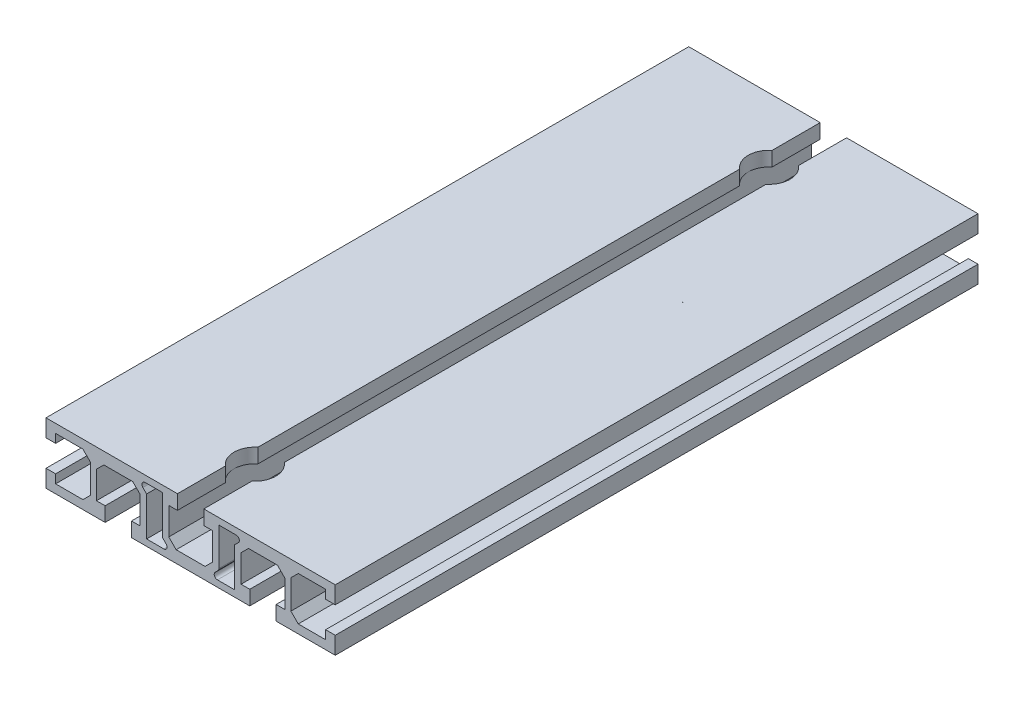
from build123d import *

# Parameters (mm, degrees)
EXTRUDE1_DEPTH      = 100
EXTRUDE1_DEPTH_BACK = 100
SKETCH2_R           = 6.5
EXTRUDE2_DEPTH      = 100


with BuildPart() as part:
    # Sketch1 → Extrude1 (new, two sides: drawn at the far end of the back side and taken through both)
    with BuildSketch(Plane.XY.offset(-EXTRUDE1_DEPTH_BACK)):
        Polygon((-18.4, -9.5), (18.4, -9.5), (18.4, -5), (15.7, -5), (15.7, 3.5), (18, 5.8), (27, 5.8), (29.3, 3.5), (29.3, -5), (26.6, -5), (26.6, -9.5), (45, -9.5), (45, -4.1), (42, -4.1), (42, -6.8), (33.5, -6.8), (31.2, -4.5), (31.2, 4.5), (33.5, 6.8), (42, 6.8), (42, 4.1), (45, 4.1), (45, 9.5), (4.1, 9.5), (4.1, 5), (6.8, 5), (6.8, -3.5), (4.5, -5.8), (-4.5, -5.8), (-6.8, -3.5), (-6.8, 5), (-4.1, 5), (-4.1, 9.5), (-45, 9.5), (-45, 4.1), (-42, 4.1), (-42, 6.8), (-33.5, 6.8), (-31.2, 4.5), (-31.2, -4.5), (-33.5, -6.8), (-42, -6.8), (-42, -4.1), (-45, -4.1), (-45, -9.5), (-26.6, -9.5), (-26.6, -5), (-29.3, -5), (-29.3, 3.5), (-27, 5.8), (-18, 5.8), (-15.7, 3.5), (-15.7, -5), (-18.4, -5), align=None)
        with BuildLine():
            Line((-8.342672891, -7.500000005), (-13.700000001, -7.500000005))
            Line((-13.700000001, -7.500000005), (-13.700000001, 4.628406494))
            Line((-13.700000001, 4.628406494), (-14.864479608, 5.792906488))
            ThreePointArc((-14.864479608, 5.792906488), (-15.081242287, 6.882687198), (-14.157369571, 7.499993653))
            Line((-14.157369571, 7.499993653), (-8.800006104, 7.499993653))
            Line((-8.800006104, 7.499993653), (-8.800006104, -4.62845362))
            Line((-8.800006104, -4.62845362), (-7.635546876, -5.792892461))
            ThreePointArc((-7.635546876, -5.792892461), (-7.418791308, -6.882686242), (-8.342672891, -7.500000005))
        make_face(mode=Mode.SUBTRACT)
        with BuildLine():
            Line((7.635546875, -5.79289246), (8.507128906, -4.921325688))
            ThreePointArc((8.507128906, -4.921325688), (8.723890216, -4.596890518), (8.800006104, -4.214202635))
            Line((8.800006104, -4.214202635), (8.800006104, 7.499999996))
            Line((8.800006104, 7.499999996), (14.15736465, 7.499999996))
            ThreePointArc((14.15736465, 7.499999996), (15.081238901, 6.882677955), (14.864449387, 5.792892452))
            Line((14.864449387, 5.792892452), (13.700009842, 4.62843252))
            Line((13.700009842, 4.62843252), (13.700009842, -7.499990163))
            Line((13.700009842, -7.499990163), (8.342669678, -7.499990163))
            ThreePointArc((8.342669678, -7.499990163), (7.418801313, -6.882676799), (7.635546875, -5.79289246))
        make_face(mode=Mode.SUBTRACT)
    extrude(amount=EXTRUDE1_DEPTH + EXTRUDE1_DEPTH_BACK)

    # Sketch2 → Extrude2 (cut)
    with BuildSketch(Plane.XZ.offset(9.5)):
        with Locations((0, -80)):
            Circle(SKETCH2_R)
        with Locations((0, 80)):
            Circle(SKETCH2_R)
    extrude(amount=-EXTRUDE2_DEPTH, mode=Mode.SUBTRACT)


solid = part.part
